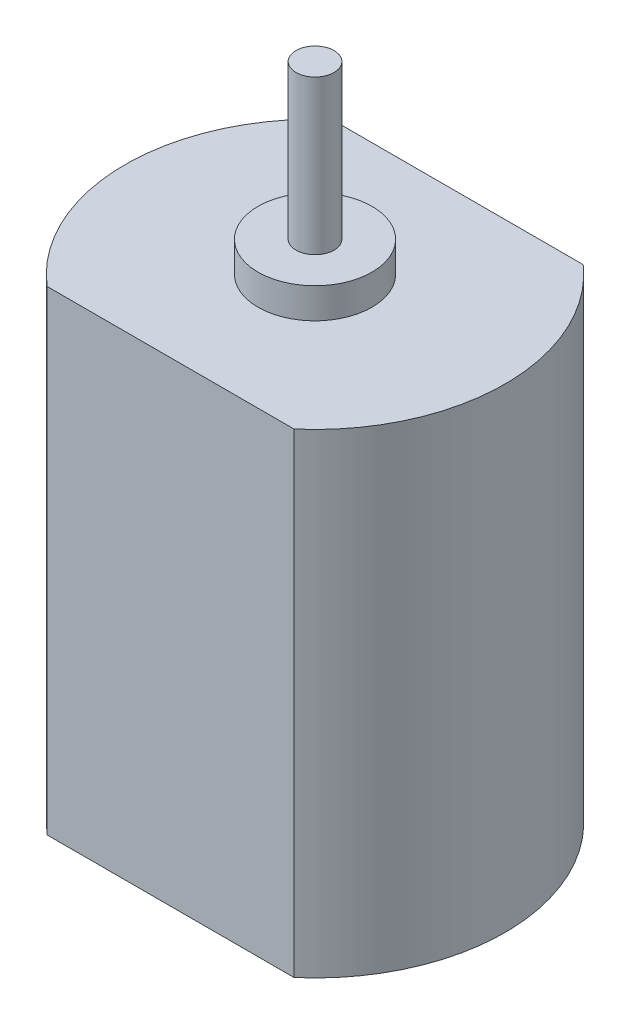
ISO-10303-21;
HEADER;
FILE_DESCRIPTION(('STEP AP214'),'2;1');
FILE_NAME('part.step','',(''),(''),'','','');
FILE_SCHEMA(('AUTOMOTIVE_DESIGN { 1 0 10303 214 1 1 1 1 }'));
ENDSEC;
DATA;
#1=APPLICATION_CONTEXT('core data for automotive mechanical design processes');
#2=APPLICATION_PROTOCOL_DEFINITION('international standard','automotive_design',2000,#1);
#3=PRODUCT_CONTEXT('',#1,'mechanical');
#4=PRODUCT('Part','Part','',(#3));
#5=PRODUCT_RELATED_PRODUCT_CATEGORY('part','',(#4));
#6=PRODUCT_DEFINITION_FORMATION('','',#4);
#7=PRODUCT_DEFINITION_CONTEXT('part definition',#1,'design');
#8=PRODUCT_DEFINITION('design','',#6,#7);
#9=PRODUCT_DEFINITION_SHAPE('','',#8);
#10=(LENGTH_UNIT() NAMED_UNIT(*) SI_UNIT(.MILLI.,.METRE.));
#11=(NAMED_UNIT(*) PLANE_ANGLE_UNIT() SI_UNIT($,.RADIAN.));
#12=(NAMED_UNIT(*) SI_UNIT($,.STERADIAN.) SOLID_ANGLE_UNIT());
#13=UNCERTAINTY_MEASURE_WITH_UNIT(LENGTH_MEASURE(1.E-05),#10,'distance_accuracy_value','');
#14=(GEOMETRIC_REPRESENTATION_CONTEXT(3) GLOBAL_UNCERTAINTY_ASSIGNED_CONTEXT((#13)) GLOBAL_UNIT_ASSIGNED_CONTEXT((#10,
#11,#12)) REPRESENTATION_CONTEXT('',''));
#15=CARTESIAN_POINT('',(0.,0.,0.));
#16=DIRECTION('',(0.,0.,1.));
#17=DIRECTION('',(1.,0.,0.));
#18=AXIS2_PLACEMENT_3D('',#15,#16,#17);
#19=CARTESIAN_POINT('',(0.,25.,0.));
#20=DIRECTION('',(0.,-1.,0.));
#21=DIRECTION('',(0.,0.,-1.));
#22=AXIS2_PLACEMENT_3D('',#19,#20,#21);
#23=CYLINDRICAL_SURFACE('',#22,10.);
#24=CARTESIAN_POINT('',(0.,0.,0.));
#25=DIRECTION('',(0.,1.,0.));
#26=DIRECTION('',(0.,0.,1.));
#27=AXIS2_PLACEMENT_3D('',#24,#25,#26);
#28=CIRCLE('',#27,10.);
#29=CARTESIAN_POINT('',(-6.61592999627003,0.,-7.4986312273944));
#30=VERTEX_POINT('',#29);
#31=CARTESIAN_POINT('',(-6.49762978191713,0.,7.6013687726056));
#32=VERTEX_POINT('',#31);
#33=EDGE_CURVE('E115',#30,#32,#28,.T.);
#34=ORIENTED_EDGE('',*,*,#33,.T.);
#35=DIRECTION('',(0.,-1.,0.));
#36=VECTOR('',#35,1.);
#37=CARTESIAN_POINT('',(-6.49762978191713,25.,7.6013687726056));
#38=LINE('',#37,#36);
#39=CARTESIAN_POINT('',(-6.49762978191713,25.,7.6013687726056));
#40=VERTEX_POINT('',#39);
#41=EDGE_CURVE('E11',#40,#32,#38,.T.);
#42=ORIENTED_EDGE('',*,*,#41,.F.);
#43=CARTESIAN_POINT('',(0.,25.,0.));
#44=DIRECTION('',(0.,1.,0.));
#45=DIRECTION('',(0.,0.,1.));
#46=AXIS2_PLACEMENT_3D('',#43,#44,#45);
#47=CIRCLE('',#46,10.);
#48=CARTESIAN_POINT('',(-6.61592999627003,25.,-7.4986312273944));
#49=VERTEX_POINT('',#48);
#50=EDGE_CURVE('E98',#49,#40,#47,.T.);
#51=ORIENTED_EDGE('',*,*,#50,.F.);
#52=DIRECTION('',(0.,-1.,0.));
#53=VECTOR('',#52,1.);
#54=CARTESIAN_POINT('',(-6.61592999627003,25.,-7.4986312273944));
#55=LINE('',#54,#53);
#56=EDGE_CURVE('E111',#49,#30,#55,.T.);
#57=ORIENTED_EDGE('',*,*,#56,.T.);
#58=EDGE_LOOP('',(#34,#42,#51,#57));
#59=FACE_BOUND('',#58,.T.);
#60=ADVANCED_FACE('F45',(#59),#23,.T.);
#61=CARTESIAN_POINT('',(-6.49762978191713,25.,7.6013687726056));
#62=DIRECTION('',(0.,0.,-1.));
#63=DIRECTION('',(-1.,0.,0.));
#64=AXIS2_PLACEMENT_3D('',#61,#62,#63);
#65=PLANE('',#64);
#66=DIRECTION('',(1.,0.,0.));
#67=VECTOR('',#66,1.);
#68=CARTESIAN_POINT('',(-6.49762978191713,0.,7.6013687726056));
#69=LINE('',#68,#67);
#70=CARTESIAN_POINT('',(6.49762978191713,0.,7.6013687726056));
#71=VERTEX_POINT('',#70);
#72=EDGE_CURVE('E103',#32,#71,#69,.T.);
#73=ORIENTED_EDGE('',*,*,#72,.T.);
#74=DIRECTION('',(0.,-1.,0.));
#75=VECTOR('',#74,1.);
#76=CARTESIAN_POINT('',(6.49762978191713,25.,7.6013687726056));
#77=LINE('',#76,#75);
#78=CARTESIAN_POINT('',(6.49762978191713,25.,7.6013687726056));
#79=VERTEX_POINT('',#78);
#80=EDGE_CURVE('E55',#79,#71,#77,.T.);
#81=ORIENTED_EDGE('',*,*,#80,.F.);
#82=DIRECTION('',(1.,0.,0.));
#83=VECTOR('',#82,1.);
#84=CARTESIAN_POINT('',(-6.49762978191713,25.,7.6013687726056));
#85=LINE('',#84,#83);
#86=EDGE_CURVE('E93',#40,#79,#85,.T.);
#87=ORIENTED_EDGE('',*,*,#86,.F.);
#88=ORIENTED_EDGE('',*,*,#41,.T.);
#89=EDGE_LOOP('',(#73,#81,#87,#88));
#90=FACE_BOUND('',#89,.T.);
#91=ADVANCED_FACE('F102',(#90),#65,.F.);
#92=CARTESIAN_POINT('',(0.,25.,0.));
#93=DIRECTION('',(0.,-1.,0.));
#94=DIRECTION('',(0.,0.,-1.));
#95=AXIS2_PLACEMENT_3D('',#92,#93,#94);
#96=CYLINDRICAL_SURFACE('',#95,10.);
#97=CARTESIAN_POINT('',(0.,0.,0.));
#98=DIRECTION('',(0.,1.,0.));
#99=DIRECTION('',(0.,0.,1.));
#100=AXIS2_PLACEMENT_3D('',#97,#98,#99);
#101=CIRCLE('',#100,10.);
#102=CARTESIAN_POINT('',(6.61592999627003,0.,-7.4986312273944));
#103=VERTEX_POINT('',#102);
#104=EDGE_CURVE('E80',#71,#103,#101,.T.);
#105=ORIENTED_EDGE('',*,*,#104,.T.);
#106=DIRECTION('',(0.,-1.,0.));
#107=VECTOR('',#106,1.);
#108=CARTESIAN_POINT('',(6.61592999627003,25.,-7.4986312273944));
#109=LINE('',#108,#107);
#110=CARTESIAN_POINT('',(6.61592999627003,25.,-7.4986312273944));
#111=VERTEX_POINT('',#110);
#112=EDGE_CURVE('E105',#111,#103,#109,.T.);
#113=ORIENTED_EDGE('',*,*,#112,.F.);
#114=CARTESIAN_POINT('',(0.,25.,0.));
#115=DIRECTION('',(0.,1.,0.));
#116=DIRECTION('',(0.,0.,1.));
#117=AXIS2_PLACEMENT_3D('',#114,#115,#116);
#118=CIRCLE('',#117,10.);
#119=EDGE_CURVE('E96',#79,#111,#118,.T.);
#120=ORIENTED_EDGE('',*,*,#119,.F.);
#121=ORIENTED_EDGE('',*,*,#80,.T.);
#122=EDGE_LOOP('',(#105,#113,#120,#121));
#123=FACE_BOUND('',#122,.T.);
#124=ADVANCED_FACE('F107',(#123),#96,.T.);
#125=CARTESIAN_POINT('',(-6.61592999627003,25.,-7.4986312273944));
#126=DIRECTION('',(0.,0.,1.));
#127=DIRECTION('',(1.,0.,0.));
#128=AXIS2_PLACEMENT_3D('',#125,#126,#127);
#129=PLANE('',#128);
#130=DIRECTION('',(-1.,0.,0.));
#131=VECTOR('',#130,1.);
#132=CARTESIAN_POINT('',(-6.61592999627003,0.,-7.4986312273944));
#133=LINE('',#132,#131);
#134=EDGE_CURVE('E86',#103,#30,#133,.T.);
#135=ORIENTED_EDGE('',*,*,#134,.T.);
#136=ORIENTED_EDGE('',*,*,#56,.F.);
#137=DIRECTION('',(-1.,0.,0.));
#138=VECTOR('',#137,1.);
#139=CARTESIAN_POINT('',(-6.61592999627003,25.,-7.4986312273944));
#140=LINE('',#139,#138);
#141=EDGE_CURVE('E63',#111,#49,#140,.T.);
#142=ORIENTED_EDGE('',*,*,#141,.F.);
#143=ORIENTED_EDGE('',*,*,#112,.T.);
#144=EDGE_LOOP('',(#135,#136,#142,#143));
#145=FACE_BOUND('',#144,.T.);
#146=ADVANCED_FACE('F129',(#145),#129,.F.);
#147=CARTESIAN_POINT('',(0.,25.,0.));
#148=DIRECTION('',(0.,1.,0.));
#149=DIRECTION('',(0.,0.,1.));
#150=AXIS2_PLACEMENT_3D('',#147,#148,#149);
#151=PLANE('',#150);
#152=CARTESIAN_POINT('',(0.,25.,0.));
#153=DIRECTION('',(0.,1.,0.));
#154=DIRECTION('',(0.,0.,1.));
#155=AXIS2_PLACEMENT_3D('',#152,#153,#154);
#156=CIRCLE('',#155,3.);
#157=CARTESIAN_POINT('',(0.,25.,3.));
#158=VERTEX_POINT('',#157);
#159=EDGE_CURVE('E139',#158,#158,#156,.T.);
#160=ORIENTED_EDGE('',*,*,#159,.F.);
#161=EDGE_LOOP('',(#160));
#162=FACE_BOUND('',#161,.T.);
#163=ORIENTED_EDGE('',*,*,#50,.T.);
#164=ORIENTED_EDGE('',*,*,#86,.T.);
#165=ORIENTED_EDGE('',*,*,#119,.T.);
#166=ORIENTED_EDGE('',*,*,#141,.T.);
#167=EDGE_LOOP('',(#163,#164,#165,#166));
#168=FACE_BOUND('',#167,.T.);
#169=ADVANCED_FACE('F94',(#162,#168),#151,.T.);
#170=CARTESIAN_POINT('',(0.,0.,0.));
#171=DIRECTION('',(0.,1.,0.));
#172=DIRECTION('',(0.,0.,1.));
#173=AXIS2_PLACEMENT_3D('',#170,#171,#172);
#174=PLANE('',#173);
#175=ORIENTED_EDGE('',*,*,#33,.F.);
#176=ORIENTED_EDGE('',*,*,#134,.F.);
#177=ORIENTED_EDGE('',*,*,#104,.F.);
#178=ORIENTED_EDGE('',*,*,#72,.F.);
#179=EDGE_LOOP('',(#175,#176,#177,#178));
#180=FACE_BOUND('',#179,.T.);
#181=ADVANCED_FACE('F132',(#180),#174,.F.);
#182=CARTESIAN_POINT('',(0.,26.6,0.));
#183=DIRECTION('',(0.,-1.,0.));
#184=DIRECTION('',(0.,0.,-1.));
#185=AXIS2_PLACEMENT_3D('',#182,#183,#184);
#186=CYLINDRICAL_SURFACE('',#185,3.);
#187=CARTESIAN_POINT('',(0.,26.6,0.));
#188=DIRECTION('',(0.,1.,0.));
#189=DIRECTION('',(0.,0.,1.));
#190=AXIS2_PLACEMENT_3D('',#187,#188,#189);
#191=CIRCLE('',#190,3.);
#192=CARTESIAN_POINT('',(0.,26.6,3.));
#193=VERTEX_POINT('',#192);
#194=EDGE_CURVE('E143',#193,#193,#191,.T.);
#195=ORIENTED_EDGE('',*,*,#194,.F.);
#196=EDGE_LOOP('',(#195));
#197=FACE_BOUND('',#196,.T.);
#198=ORIENTED_EDGE('',*,*,#159,.T.);
#199=EDGE_LOOP('',(#198));
#200=FACE_BOUND('',#199,.T.);
#201=ADVANCED_FACE('F158',(#197,#200),#186,.T.);
#202=CARTESIAN_POINT('',(0.,26.6,0.));
#203=DIRECTION('',(0.,1.,0.));
#204=DIRECTION('',(0.,0.,1.));
#205=AXIS2_PLACEMENT_3D('',#202,#203,#204);
#206=PLANE('',#205);
#207=CARTESIAN_POINT('',(0.,26.6,0.));
#208=DIRECTION('',(0.,1.,0.));
#209=DIRECTION('',(0.,0.,1.));
#210=AXIS2_PLACEMENT_3D('',#207,#208,#209);
#211=CIRCLE('',#210,1.);
#212=CARTESIAN_POINT('',(0.,26.6,1.));
#213=VERTEX_POINT('',#212);
#214=EDGE_CURVE('E48',#213,#213,#211,.T.);
#215=ORIENTED_EDGE('',*,*,#214,.F.);
#216=EDGE_LOOP('',(#215));
#217=FACE_BOUND('',#216,.T.);
#218=ORIENTED_EDGE('',*,*,#194,.T.);
#219=EDGE_LOOP('',(#218));
#220=FACE_BOUND('',#219,.T.);
#221=ADVANCED_FACE('F155',(#217,#220),#206,.T.);
#222=CARTESIAN_POINT('',(0.,34.7,0.));
#223=DIRECTION('',(0.,1.,0.));
#224=DIRECTION('',(0.,0.,1.));
#225=AXIS2_PLACEMENT_3D('',#222,#223,#224);
#226=PLANE('',#225);
#227=CARTESIAN_POINT('',(0.,34.7,0.));
#228=DIRECTION('',(0.,1.,0.));
#229=DIRECTION('',(0.,0.,1.));
#230=AXIS2_PLACEMENT_3D('',#227,#228,#229);
#231=CIRCLE('',#230,1.);
#232=CARTESIAN_POINT('',(0.,34.7,1.));
#233=VERTEX_POINT('',#232);
#234=EDGE_CURVE('E119',#233,#233,#231,.T.);
#235=ORIENTED_EDGE('',*,*,#234,.T.);
#236=EDGE_LOOP('',(#235));
#237=FACE_BOUND('',#236,.T.);
#238=ADVANCED_FACE('F157',(#237),#226,.T.);
#239=CARTESIAN_POINT('',(0.,34.7,0.));
#240=DIRECTION('',(0.,-1.,0.));
#241=DIRECTION('',(0.,0.,-1.));
#242=AXIS2_PLACEMENT_3D('',#239,#240,#241);
#243=CYLINDRICAL_SURFACE('',#242,1.);
#244=ORIENTED_EDGE('',*,*,#214,.T.);
#245=EDGE_LOOP('',(#244));
#246=FACE_BOUND('',#245,.T.);
#247=ORIENTED_EDGE('',*,*,#234,.F.);
#248=EDGE_LOOP('',(#247));
#249=FACE_BOUND('',#248,.T.);
#250=ADVANCED_FACE('F152',(#246,#249),#243,.T.);
#251=CLOSED_SHELL('',(#60,#91,#124,#146,#169,#181,#201,#221,#238,#250));
#252=MANIFOLD_SOLID_BREP('B2',#251);
#253=ADVANCED_BREP_SHAPE_REPRESENTATION('',(#18,#252),#14);
#254=SHAPE_DEFINITION_REPRESENTATION(#9,#253);
ENDSEC;
END-ISO-10303-21;
